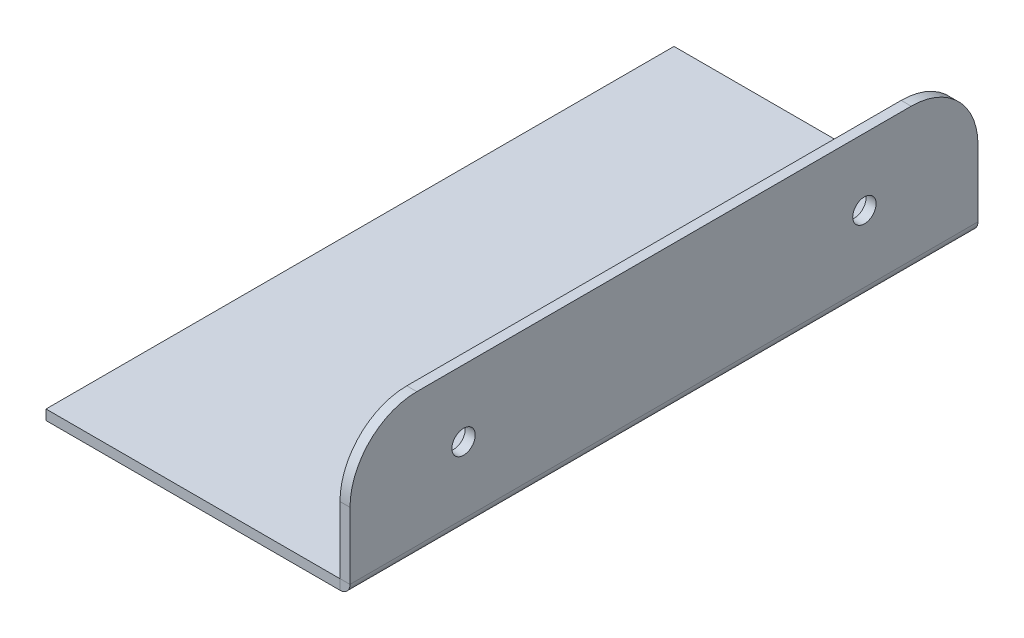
ISO-10303-21;
HEADER;
FILE_DESCRIPTION(('STEP AP214'),'2;1');
FILE_NAME('part.step','',(''),(''),'','','');
FILE_SCHEMA(('AUTOMOTIVE_DESIGN { 1 0 10303 214 1 1 1 1 }'));
ENDSEC;
DATA;
#1=APPLICATION_CONTEXT('core data for automotive mechanical design processes');
#2=APPLICATION_PROTOCOL_DEFINITION('international standard','automotive_design',2000,#1);
#3=PRODUCT_CONTEXT('',#1,'mechanical');
#4=PRODUCT('Part','Part','',(#3));
#5=PRODUCT_RELATED_PRODUCT_CATEGORY('part','',(#4));
#6=PRODUCT_DEFINITION_FORMATION('','',#4);
#7=PRODUCT_DEFINITION_CONTEXT('part definition',#1,'design');
#8=PRODUCT_DEFINITION('design','',#6,#7);
#9=PRODUCT_DEFINITION_SHAPE('','',#8);
#10=(LENGTH_UNIT() NAMED_UNIT(*) SI_UNIT(.MILLI.,.METRE.));
#11=(NAMED_UNIT(*) PLANE_ANGLE_UNIT() SI_UNIT($,.RADIAN.));
#12=(NAMED_UNIT(*) SI_UNIT($,.STERADIAN.) SOLID_ANGLE_UNIT());
#13=UNCERTAINTY_MEASURE_WITH_UNIT(LENGTH_MEASURE(1.E-05),#10,'distance_accuracy_value','');
#14=(GEOMETRIC_REPRESENTATION_CONTEXT(3) GLOBAL_UNCERTAINTY_ASSIGNED_CONTEXT((#13)) GLOBAL_UNIT_ASSIGNED_CONTEXT((#10,
#11,#12)) REPRESENTATION_CONTEXT('',''));
#15=CARTESIAN_POINT('',(0.,0.,0.));
#16=DIRECTION('',(0.,0.,1.));
#17=DIRECTION('',(1.,0.,0.));
#18=AXIS2_PLACEMENT_3D('',#15,#16,#17);
#19=CARTESIAN_POINT('',(44.0021342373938,-42.4978657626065,-94.));
#20=DIRECTION('',(0.,0.,1.));
#21=DIRECTION('',(0.,1.,0.));
#22=AXIS2_PLACEMENT_3D('',#19,#20,#21);
#23=PLANE('',#22);
#24=DIRECTION('',(0.,-1.,0.));
#25=VECTOR('',#24,1.);
#26=CARTESIAN_POINT('',(45.5021342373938,-42.4978657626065,-94.));
#27=LINE('',#26,#25);
#28=CARTESIAN_POINT('',(45.5021342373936,11.5021342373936,-94.));
#29=VERTEX_POINT('',#28);
#30=CARTESIAN_POINT('',(45.5021342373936,1.51,-94.));
#31=VERTEX_POINT('',#30);
#32=EDGE_CURVE('E61',#29,#31,#27,.T.);
#33=ORIENTED_EDGE('',*,*,#32,.T.);
#34=DIRECTION('',(-1.,0.,0.));
#35=VECTOR('',#34,1.);
#36=CARTESIAN_POINT('',(44.0021342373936,1.51,-94.));
#37=LINE('',#36,#35);
#38=CARTESIAN_POINT('',(44.0021342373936,1.51,-94.));
#39=VERTEX_POINT('',#38);
#40=EDGE_CURVE('E226',#31,#39,#37,.T.);
#41=ORIENTED_EDGE('',*,*,#40,.T.);
#42=DIRECTION('',(0.,-1.,0.));
#43=VECTOR('',#42,1.);
#44=CARTESIAN_POINT('',(44.0021342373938,-42.4978657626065,-94.));
#45=LINE('',#44,#43);
#46=CARTESIAN_POINT('',(44.0021342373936,11.5021342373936,-94.));
#47=VERTEX_POINT('',#46);
#48=EDGE_CURVE('E207',#47,#39,#45,.T.);
#49=ORIENTED_EDGE('',*,*,#48,.F.);
#50=DIRECTION('',(1.,0.,0.));
#51=VECTOR('',#50,1.);
#52=CARTESIAN_POINT('',(44.0021342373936,11.5021342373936,-94.));
#53=LINE('',#52,#51);
#54=EDGE_CURVE('E214',#47,#29,#53,.T.);
#55=ORIENTED_EDGE('',*,*,#54,.T.);
#56=EDGE_LOOP('',(#33,#41,#49,#55));
#57=FACE_BOUND('',#56,.T.);
#58=ADVANCED_FACE('F37',(#57),#23,.F.);
#59=CARTESIAN_POINT('',(44.0021342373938,-42.4978657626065,0.));
#60=DIRECTION('',(0.,0.,-1.));
#61=DIRECTION('',(0.,-1.,0.));
#62=AXIS2_PLACEMENT_3D('',#59,#60,#61);
#63=PLANE('',#62);
#64=DIRECTION('',(0.,1.,0.));
#65=VECTOR('',#64,1.);
#66=CARTESIAN_POINT('',(44.0021342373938,-42.4978657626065,0.));
#67=LINE('',#66,#65);
#68=CARTESIAN_POINT('',(44.0021342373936,1.51,0.));
#69=VERTEX_POINT('',#68);
#70=CARTESIAN_POINT('',(44.0021342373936,11.5021342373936,0.));
#71=VERTEX_POINT('',#70);
#72=EDGE_CURVE('E41',#69,#71,#67,.T.);
#73=ORIENTED_EDGE('',*,*,#72,.F.);
#74=DIRECTION('',(1.,0.,0.));
#75=VECTOR('',#74,1.);
#76=CARTESIAN_POINT('',(44.0021342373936,1.51,0.));
#77=LINE('',#76,#75);
#78=CARTESIAN_POINT('',(45.5021342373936,1.51,0.));
#79=VERTEX_POINT('',#78);
#80=EDGE_CURVE('E12',#69,#79,#77,.T.);
#81=ORIENTED_EDGE('',*,*,#80,.T.);
#82=DIRECTION('',(0.,1.,0.));
#83=VECTOR('',#82,1.);
#84=CARTESIAN_POINT('',(45.5021342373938,-42.4978657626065,0.));
#85=LINE('',#84,#83);
#86=CARTESIAN_POINT('',(45.5021342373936,11.5021342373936,0.));
#87=VERTEX_POINT('',#86);
#88=EDGE_CURVE('E54',#79,#87,#85,.T.);
#89=ORIENTED_EDGE('',*,*,#88,.T.);
#90=DIRECTION('',(1.,0.,0.));
#91=VECTOR('',#90,1.);
#92=CARTESIAN_POINT('',(44.0021342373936,11.5021342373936,0.));
#93=LINE('',#92,#91);
#94=EDGE_CURVE('E222',#71,#87,#93,.T.);
#95=ORIENTED_EDGE('',*,*,#94,.F.);
#96=EDGE_LOOP('',(#73,#81,#89,#95));
#97=FACE_BOUND('',#96,.T.);
#98=ADVANCED_FACE('F39',(#97),#63,.F.);
#99=CARTESIAN_POINT('',(45.5021342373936,11.5021342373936,-84.));
#100=DIRECTION('',(-1.,0.,0.));
#101=DIRECTION('',(0.,0.,1.));
#102=AXIS2_PLACEMENT_3D('',#99,#100,#101);
#103=PLANE('',#102);
#104=CARTESIAN_POINT('',(45.5021342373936,11.5021342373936,-17.));
#105=DIRECTION('',(-1.,0.,0.));
#106=DIRECTION('',(0.,0.,1.));
#107=AXIS2_PLACEMENT_3D('',#104,#105,#106);
#108=CIRCLE('',#107,1.75);
#109=CARTESIAN_POINT('',(45.5021342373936,11.5021342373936,-15.25));
#110=VERTEX_POINT('',#109);
#111=EDGE_CURVE('E166',#110,#110,#108,.T.);
#112=ORIENTED_EDGE('',*,*,#111,.T.);
#113=EDGE_LOOP('',(#112));
#114=FACE_BOUND('',#113,.T.);
#115=CARTESIAN_POINT('',(45.5021342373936,11.5021342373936,-77.));
#116=DIRECTION('',(-1.,0.,0.));
#117=DIRECTION('',(0.,0.,1.));
#118=AXIS2_PLACEMENT_3D('',#115,#116,#117);
#119=CIRCLE('',#118,1.75);
#120=CARTESIAN_POINT('',(45.5021342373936,11.5021342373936,-75.25));
#121=VERTEX_POINT('',#120);
#122=EDGE_CURVE('E193',#121,#121,#119,.T.);
#123=ORIENTED_EDGE('',*,*,#122,.T.);
#124=EDGE_LOOP('',(#123));
#125=FACE_BOUND('',#124,.T.);
#126=ORIENTED_EDGE('',*,*,#88,.F.);
#127=DIRECTION('',(0.,0.,-1.));
#128=VECTOR('',#127,1.);
#129=CARTESIAN_POINT('',(45.5021342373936,1.51,-84.));
#130=LINE('',#129,#128);
#131=EDGE_CURVE('E46',#79,#31,#130,.T.);
#132=ORIENTED_EDGE('',*,*,#131,.T.);
#133=ORIENTED_EDGE('',*,*,#32,.F.);
#134=CARTESIAN_POINT('',(45.5021342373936,11.5021342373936,-84.));
#135=DIRECTION('',(-1.,0.,0.));
#136=DIRECTION('',(0.,0.,1.));
#137=AXIS2_PLACEMENT_3D('',#134,#135,#136);
#138=CIRCLE('',#137,9.99999999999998);
#139=CARTESIAN_POINT('',(45.5021342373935,21.5021342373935,-84.));
#140=VERTEX_POINT('',#139);
#141=EDGE_CURVE('E212',#140,#29,#138,.T.);
#142=ORIENTED_EDGE('',*,*,#141,.F.);
#143=DIRECTION('',(0.,0.,-1.));
#144=VECTOR('',#143,1.);
#145=CARTESIAN_POINT('',(45.5021342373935,21.5021342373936,-10.));
#146=LINE('',#145,#144);
#147=CARTESIAN_POINT('',(45.5021342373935,21.5021342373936,-10.));
#148=VERTEX_POINT('',#147);
#149=EDGE_CURVE('E210',#148,#140,#146,.T.);
#150=ORIENTED_EDGE('',*,*,#149,.F.);
#151=CARTESIAN_POINT('',(45.5021342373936,11.5021342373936,-10.));
#152=DIRECTION('',(-1.,0.,0.));
#153=DIRECTION('',(0.,0.,1.));
#154=AXIS2_PLACEMENT_3D('',#151,#152,#153);
#155=CIRCLE('',#154,10.);
#156=EDGE_CURVE('E208',#87,#148,#155,.T.);
#157=ORIENTED_EDGE('',*,*,#156,.F.);
#158=EDGE_LOOP('',(#126,#132,#133,#142,#150,#157));
#159=FACE_BOUND('',#158,.T.);
#160=ADVANCED_FACE('F275',(#114,#125,#159),#103,.F.);
#161=CARTESIAN_POINT('',(44.0021342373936,11.5021342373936,-84.));
#162=DIRECTION('',(-1.,0.,0.));
#163=DIRECTION('',(0.,0.,1.));
#164=AXIS2_PLACEMENT_3D('',#161,#162,#163);
#165=PLANE('',#164);
#166=DIRECTION('',(0.,0.,-1.));
#167=VECTOR('',#166,1.);
#168=CARTESIAN_POINT('',(44.0021342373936,1.51,-84.));
#169=LINE('',#168,#167);
#170=EDGE_CURVE('E152',#69,#39,#169,.T.);
#171=ORIENTED_EDGE('',*,*,#170,.F.);
#172=ORIENTED_EDGE('',*,*,#72,.T.);
#173=CARTESIAN_POINT('',(44.0021342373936,11.5021342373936,-10.));
#174=DIRECTION('',(-1.,0.,0.));
#175=DIRECTION('',(0.,0.,1.));
#176=AXIS2_PLACEMENT_3D('',#173,#174,#175);
#177=CIRCLE('',#176,10.);
#178=CARTESIAN_POINT('',(44.0021342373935,21.5021342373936,-10.));
#179=VERTEX_POINT('',#178);
#180=EDGE_CURVE('E201',#71,#179,#177,.T.);
#181=ORIENTED_EDGE('',*,*,#180,.T.);
#182=DIRECTION('',(0.,0.,-1.));
#183=VECTOR('',#182,1.);
#184=CARTESIAN_POINT('',(44.0021342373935,21.5021342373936,-10.));
#185=LINE('',#184,#183);
#186=CARTESIAN_POINT('',(44.0021342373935,21.5021342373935,-84.));
#187=VERTEX_POINT('',#186);
#188=EDGE_CURVE('E203',#179,#187,#185,.T.);
#189=ORIENTED_EDGE('',*,*,#188,.T.);
#190=CARTESIAN_POINT('',(44.0021342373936,11.5021342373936,-84.));
#191=DIRECTION('',(-1.,0.,0.));
#192=DIRECTION('',(0.,0.,1.));
#193=AXIS2_PLACEMENT_3D('',#190,#191,#192);
#194=CIRCLE('',#193,9.99999999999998);
#195=EDGE_CURVE('E205',#187,#47,#194,.T.);
#196=ORIENTED_EDGE('',*,*,#195,.T.);
#197=ORIENTED_EDGE('',*,*,#48,.T.);
#198=EDGE_LOOP('',(#171,#172,#181,#189,#196,#197));
#199=FACE_BOUND('',#198,.T.);
#200=CARTESIAN_POINT('',(44.0021342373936,11.5021342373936,-77.));
#201=DIRECTION('',(-1.,0.,0.));
#202=DIRECTION('',(0.,0.,1.));
#203=AXIS2_PLACEMENT_3D('',#200,#201,#202);
#204=CIRCLE('',#203,1.75);
#205=CARTESIAN_POINT('',(44.0021342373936,11.5021342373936,-75.25));
#206=VERTEX_POINT('',#205);
#207=EDGE_CURVE('E196',#206,#206,#204,.T.);
#208=ORIENTED_EDGE('',*,*,#207,.F.);
#209=EDGE_LOOP('',(#208));
#210=FACE_BOUND('',#209,.T.);
#211=CARTESIAN_POINT('',(44.0021342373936,11.5021342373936,-17.));
#212=DIRECTION('',(-1.,0.,0.));
#213=DIRECTION('',(0.,0.,1.));
#214=AXIS2_PLACEMENT_3D('',#211,#212,#213);
#215=CIRCLE('',#214,1.75);
#216=CARTESIAN_POINT('',(44.0021342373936,11.5021342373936,-15.25));
#217=VERTEX_POINT('',#216);
#218=EDGE_CURVE('E190',#217,#217,#215,.T.);
#219=ORIENTED_EDGE('',*,*,#218,.F.);
#220=EDGE_LOOP('',(#219));
#221=FACE_BOUND('',#220,.T.);
#222=ADVANCED_FACE('F233',(#199,#210,#221),#165,.T.);
#223=CARTESIAN_POINT('',(44.0021342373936,11.5021342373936,-10.));
#224=DIRECTION('',(1.,0.,0.));
#225=DIRECTION('',(0.,0.,-1.));
#226=AXIS2_PLACEMENT_3D('',#223,#224,#225);
#227=CYLINDRICAL_SURFACE('',#226,10.);
#228=ORIENTED_EDGE('',*,*,#156,.T.);
#229=DIRECTION('',(1.,0.,0.));
#230=VECTOR('',#229,1.);
#231=CARTESIAN_POINT('',(44.0021342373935,21.5021342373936,-10.));
#232=LINE('',#231,#230);
#233=EDGE_CURVE('E219',#179,#148,#232,.T.);
#234=ORIENTED_EDGE('',*,*,#233,.F.);
#235=ORIENTED_EDGE('',*,*,#180,.F.);
#236=ORIENTED_EDGE('',*,*,#94,.T.);
#237=EDGE_LOOP('',(#228,#234,#235,#236));
#238=FACE_BOUND('',#237,.T.);
#239=ADVANCED_FACE('F284',(#238),#227,.T.);
#240=CARTESIAN_POINT('',(44.0021342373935,21.5021342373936,-10.));
#241=DIRECTION('',(0.,-1.,0.));
#242=DIRECTION('',(0.,0.,1.));
#243=AXIS2_PLACEMENT_3D('',#240,#241,#242);
#244=PLANE('',#243);
#245=ORIENTED_EDGE('',*,*,#149,.T.);
#246=DIRECTION('',(1.,0.,0.));
#247=VECTOR('',#246,1.);
#248=CARTESIAN_POINT('',(44.0021342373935,21.5021342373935,-84.));
#249=LINE('',#248,#247);
#250=EDGE_CURVE('E216',#187,#140,#249,.T.);
#251=ORIENTED_EDGE('',*,*,#250,.F.);
#252=ORIENTED_EDGE('',*,*,#188,.F.);
#253=ORIENTED_EDGE('',*,*,#233,.T.);
#254=EDGE_LOOP('',(#245,#251,#252,#253));
#255=FACE_BOUND('',#254,.T.);
#256=ADVANCED_FACE('F296',(#255),#244,.F.);
#257=CARTESIAN_POINT('',(44.0021342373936,11.5021342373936,-84.));
#258=DIRECTION('',(1.,0.,0.));
#259=DIRECTION('',(0.,0.,-1.));
#260=AXIS2_PLACEMENT_3D('',#257,#258,#259);
#261=CYLINDRICAL_SURFACE('',#260,9.99999999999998);
#262=ORIENTED_EDGE('',*,*,#141,.T.);
#263=ORIENTED_EDGE('',*,*,#54,.F.);
#264=ORIENTED_EDGE('',*,*,#195,.F.);
#265=ORIENTED_EDGE('',*,*,#250,.T.);
#266=EDGE_LOOP('',(#262,#263,#264,#265));
#267=FACE_BOUND('',#266,.T.);
#268=ADVANCED_FACE('F290',(#267),#261,.T.);
#269=CARTESIAN_POINT('',(44.0021342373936,11.5021342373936,-77.));
#270=DIRECTION('',(1.,0.,0.));
#271=DIRECTION('',(0.,0.,-1.));
#272=AXIS2_PLACEMENT_3D('',#269,#270,#271);
#273=CYLINDRICAL_SURFACE('',#272,1.75);
#274=ORIENTED_EDGE('',*,*,#207,.T.);
#275=EDGE_LOOP('',(#274));
#276=FACE_BOUND('',#275,.T.);
#277=ORIENTED_EDGE('',*,*,#122,.F.);
#278=EDGE_LOOP('',(#277));
#279=FACE_BOUND('',#278,.T.);
#280=ADVANCED_FACE('F266',(#276,#279),#273,.F.);
#281=CARTESIAN_POINT('',(44.0021342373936,11.5021342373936,-17.));
#282=DIRECTION('',(1.,0.,0.));
#283=DIRECTION('',(0.,0.,-1.));
#284=AXIS2_PLACEMENT_3D('',#281,#282,#283);
#285=CYLINDRICAL_SURFACE('',#284,1.75);
#286=ORIENTED_EDGE('',*,*,#218,.T.);
#287=EDGE_LOOP('',(#286));
#288=FACE_BOUND('',#287,.T.);
#289=ORIENTED_EDGE('',*,*,#111,.F.);
#290=EDGE_LOOP('',(#289));
#291=FACE_BOUND('',#290,.T.);
#292=ADVANCED_FACE('F257',(#288,#291),#285,.F.);
#293=CARTESIAN_POINT('',(0.,1.5,0.));
#294=DIRECTION('',(1.,0.,0.));
#295=DIRECTION('',(0.,0.,-1.));
#296=AXIS2_PLACEMENT_3D('',#293,#294,#295);
#297=PLANE('',#296);
#298=DIRECTION('',(0.,0.,1.));
#299=VECTOR('',#298,1.);
#300=CARTESIAN_POINT('',(0.,0.,0.));
#301=LINE('',#300,#299);
#302=CARTESIAN_POINT('',(0.,0.,-94.));
#303=VERTEX_POINT('',#302);
#304=CARTESIAN_POINT('',(0.,0.,0.));
#305=VERTEX_POINT('',#304);
#306=EDGE_CURVE('E147',#303,#305,#301,.T.);
#307=ORIENTED_EDGE('',*,*,#306,.T.);
#308=DIRECTION('',(0.,-1.,0.));
#309=VECTOR('',#308,1.);
#310=CARTESIAN_POINT('',(0.,1.5,0.));
#311=LINE('',#310,#309);
#312=CARTESIAN_POINT('',(0.,1.5,0.));
#313=VERTEX_POINT('',#312);
#314=EDGE_CURVE('E167',#313,#305,#311,.T.);
#315=ORIENTED_EDGE('',*,*,#314,.F.);
#316=DIRECTION('',(0.,0.,1.));
#317=VECTOR('',#316,1.);
#318=CARTESIAN_POINT('',(0.,1.5,0.));
#319=LINE('',#318,#317);
#320=CARTESIAN_POINT('',(0.,1.5,-94.));
#321=VERTEX_POINT('',#320);
#322=EDGE_CURVE('E127',#321,#313,#319,.T.);
#323=ORIENTED_EDGE('',*,*,#322,.F.);
#324=DIRECTION('',(0.,-1.,0.));
#325=VECTOR('',#324,1.);
#326=CARTESIAN_POINT('',(0.,1.5,-94.));
#327=LINE('',#326,#325);
#328=EDGE_CURVE('E123',#321,#303,#327,.T.);
#329=ORIENTED_EDGE('',*,*,#328,.T.);
#330=EDGE_LOOP('',(#307,#315,#323,#329));
#331=FACE_BOUND('',#330,.T.);
#332=ADVANCED_FACE('F254',(#331),#297,.F.);
#333=CARTESIAN_POINT('',(34.,1.5,-17.));
#334=DIRECTION('',(0.,-1.,0.));
#335=DIRECTION('',(0.,0.,-1.));
#336=AXIS2_PLACEMENT_3D('',#333,#334,#335);
#337=CYLINDRICAL_SURFACE('',#336,1.75);
#338=CARTESIAN_POINT('',(34.,1.5,-17.));
#339=DIRECTION('',(0.,1.,0.));
#340=DIRECTION('',(0.,0.,1.));
#341=AXIS2_PLACEMENT_3D('',#338,#339,#340);
#342=CIRCLE('',#341,1.75);
#343=CARTESIAN_POINT('',(34.,1.5,-15.25));
#344=VERTEX_POINT('',#343);
#345=EDGE_CURVE('E183',#344,#344,#342,.T.);
#346=ORIENTED_EDGE('',*,*,#345,.T.);
#347=EDGE_LOOP('',(#346));
#348=FACE_BOUND('',#347,.T.);
#349=CARTESIAN_POINT('',(34.,0.,-17.));
#350=DIRECTION('',(0.,1.,0.));
#351=DIRECTION('',(0.,0.,1.));
#352=AXIS2_PLACEMENT_3D('',#349,#350,#351);
#353=CIRCLE('',#352,1.75);
#354=CARTESIAN_POINT('',(34.,0.,-15.25));
#355=VERTEX_POINT('',#354);
#356=EDGE_CURVE('E170',#355,#355,#353,.T.);
#357=ORIENTED_EDGE('',*,*,#356,.F.);
#358=EDGE_LOOP('',(#357));
#359=FACE_BOUND('',#358,.T.);
#360=ADVANCED_FACE('F256',(#348,#359),#337,.F.);
#361=CARTESIAN_POINT('',(34.,1.5,-77.));
#362=DIRECTION('',(0.,-1.,0.));
#363=DIRECTION('',(0.,0.,-1.));
#364=AXIS2_PLACEMENT_3D('',#361,#362,#363);
#365=CYLINDRICAL_SURFACE('',#364,1.75);
#366=CARTESIAN_POINT('',(34.,1.5,-77.));
#367=DIRECTION('',(0.,1.,0.));
#368=DIRECTION('',(0.,0.,1.));
#369=AXIS2_PLACEMENT_3D('',#366,#367,#368);
#370=CIRCLE('',#369,1.75);
#371=CARTESIAN_POINT('',(34.,1.5,-75.25));
#372=VERTEX_POINT('',#371);
#373=EDGE_CURVE('E180',#372,#372,#370,.T.);
#374=ORIENTED_EDGE('',*,*,#373,.T.);
#375=EDGE_LOOP('',(#374));
#376=FACE_BOUND('',#375,.T.);
#377=CARTESIAN_POINT('',(34.,0.,-77.));
#378=DIRECTION('',(0.,1.,0.));
#379=DIRECTION('',(0.,0.,1.));
#380=AXIS2_PLACEMENT_3D('',#377,#378,#379);
#381=CIRCLE('',#380,1.75);
#382=CARTESIAN_POINT('',(34.,0.,-75.25));
#383=VERTEX_POINT('',#382);
#384=EDGE_CURVE('E173',#383,#383,#381,.T.);
#385=ORIENTED_EDGE('',*,*,#384,.F.);
#386=EDGE_LOOP('',(#385));
#387=FACE_BOUND('',#386,.T.);
#388=ADVANCED_FACE('F263',(#376,#387),#365,.F.);
#389=CARTESIAN_POINT('',(54.,1.5,-84.));
#390=DIRECTION('',(0.,1.,0.));
#391=DIRECTION('',(0.,0.,1.));
#392=AXIS2_PLACEMENT_3D('',#389,#390,#391);
#393=PLANE('',#392);
#394=ORIENTED_EDGE('',*,*,#373,.F.);
#395=EDGE_LOOP('',(#394));
#396=FACE_BOUND('',#395,.T.);
#397=ORIENTED_EDGE('',*,*,#345,.F.);
#398=EDGE_LOOP('',(#397));
#399=FACE_BOUND('',#398,.T.);
#400=DIRECTION('',(1.,0.,0.));
#401=VECTOR('',#400,1.);
#402=CARTESIAN_POINT('',(0.,1.5,0.));
#403=LINE('',#402,#401);
#404=CARTESIAN_POINT('',(43.9921342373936,1.5,0.));
#405=VERTEX_POINT('',#404);
#406=EDGE_CURVE('E132',#313,#405,#403,.T.);
#407=ORIENTED_EDGE('',*,*,#406,.T.);
#408=DIRECTION('',(0.,0.,-1.));
#409=VECTOR('',#408,1.);
#410=CARTESIAN_POINT('',(43.9921342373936,1.5,-84.));
#411=LINE('',#410,#409);
#412=CARTESIAN_POINT('',(43.9921342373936,1.5,-94.));
#413=VERTEX_POINT('',#412);
#414=EDGE_CURVE('E128',#405,#413,#411,.T.);
#415=ORIENTED_EDGE('',*,*,#414,.T.);
#416=DIRECTION('',(-1.,0.,0.));
#417=VECTOR('',#416,1.);
#418=CARTESIAN_POINT('',(0.,1.5,-94.));
#419=LINE('',#418,#417);
#420=EDGE_CURVE('E116',#413,#321,#419,.T.);
#421=ORIENTED_EDGE('',*,*,#420,.T.);
#422=ORIENTED_EDGE('',*,*,#322,.T.);
#423=EDGE_LOOP('',(#407,#415,#421,#422));
#424=FACE_BOUND('',#423,.T.);
#425=ADVANCED_FACE('F131',(#396,#399,#424),#393,.T.);
#426=CARTESIAN_POINT('',(0.,1.5,-94.));
#427=DIRECTION('',(0.,0.,1.));
#428=DIRECTION('',(1.,0.,0.));
#429=AXIS2_PLACEMENT_3D('',#426,#427,#428);
#430=PLANE('',#429);
#431=DIRECTION('',(0.,1.,0.));
#432=VECTOR('',#431,1.);
#433=CARTESIAN_POINT('',(43.9921342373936,1.5,-94.));
#434=LINE('',#433,#432);
#435=CARTESIAN_POINT('',(43.9921342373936,0.,-94.));
#436=VERTEX_POINT('',#435);
#437=EDGE_CURVE('E120',#436,#413,#434,.T.);
#438=ORIENTED_EDGE('',*,*,#437,.F.);
#439=DIRECTION('',(-1.,0.,0.));
#440=VECTOR('',#439,1.);
#441=CARTESIAN_POINT('',(0.,0.,-94.));
#442=LINE('',#441,#440);
#443=EDGE_CURVE('E176',#436,#303,#442,.T.);
#444=ORIENTED_EDGE('',*,*,#443,.T.);
#445=ORIENTED_EDGE('',*,*,#328,.F.);
#446=ORIENTED_EDGE('',*,*,#420,.F.);
#447=EDGE_LOOP('',(#438,#444,#445,#446));
#448=FACE_BOUND('',#447,.T.);
#449=ADVANCED_FACE('F118',(#448),#430,.F.);
#450=CARTESIAN_POINT('',(54.,0.,-84.));
#451=DIRECTION('',(0.,1.,0.));
#452=DIRECTION('',(0.,0.,1.));
#453=AXIS2_PLACEMENT_3D('',#450,#451,#452);
#454=PLANE('',#453);
#455=DIRECTION('',(0.,0.,-1.));
#456=VECTOR('',#455,1.);
#457=CARTESIAN_POINT('',(43.9921342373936,0.,-84.));
#458=LINE('',#457,#456);
#459=CARTESIAN_POINT('',(43.9921342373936,0.,0.));
#460=VERTEX_POINT('',#459);
#461=EDGE_CURVE('E148',#460,#436,#458,.T.);
#462=ORIENTED_EDGE('',*,*,#461,.F.);
#463=DIRECTION('',(1.,0.,0.));
#464=VECTOR('',#463,1.);
#465=CARTESIAN_POINT('',(0.,0.,0.));
#466=LINE('',#465,#464);
#467=EDGE_CURVE('E164',#305,#460,#466,.T.);
#468=ORIENTED_EDGE('',*,*,#467,.F.);
#469=ORIENTED_EDGE('',*,*,#306,.F.);
#470=ORIENTED_EDGE('',*,*,#443,.F.);
#471=EDGE_LOOP('',(#462,#468,#469,#470));
#472=FACE_BOUND('',#471,.T.);
#473=ORIENTED_EDGE('',*,*,#384,.T.);
#474=EDGE_LOOP('',(#473));
#475=FACE_BOUND('',#474,.T.);
#476=ORIENTED_EDGE('',*,*,#356,.T.);
#477=EDGE_LOOP('',(#476));
#478=FACE_BOUND('',#477,.T.);
#479=ADVANCED_FACE('F244',(#472,#475,#478),#454,.F.);
#480=CARTESIAN_POINT('',(0.,1.5,0.));
#481=DIRECTION('',(0.,0.,-1.));
#482=DIRECTION('',(-1.,0.,0.));
#483=AXIS2_PLACEMENT_3D('',#480,#481,#482);
#484=PLANE('',#483);
#485=DIRECTION('',(0.,-1.,0.));
#486=VECTOR('',#485,1.);
#487=CARTESIAN_POINT('',(43.9921342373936,1.5,0.));
#488=LINE('',#487,#486);
#489=EDGE_CURVE('E153',#405,#460,#488,.T.);
#490=ORIENTED_EDGE('',*,*,#489,.F.);
#491=ORIENTED_EDGE('',*,*,#406,.F.);
#492=ORIENTED_EDGE('',*,*,#314,.T.);
#493=ORIENTED_EDGE('',*,*,#467,.T.);
#494=EDGE_LOOP('',(#490,#491,#492,#493));
#495=FACE_BOUND('',#494,.T.);
#496=ADVANCED_FACE('F251',(#495),#484,.F.);
#497=CARTESIAN_POINT('',(43.9921342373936,1.51,0.));
#498=DIRECTION('',(0.,0.,-1.));
#499=DIRECTION('',(-1.,0.,0.));
#500=AXIS2_PLACEMENT_3D('',#497,#498,#499);
#501=PLANE('',#500);
#502=ORIENTED_EDGE('',*,*,#489,.T.);
#503=CARTESIAN_POINT('',(43.9921342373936,1.51,0.));
#504=DIRECTION('',(0.,0.,-1.));
#505=DIRECTION('',(-1.,0.,0.));
#506=AXIS2_PLACEMENT_3D('',#503,#504,#505);
#507=CIRCLE('',#506,1.51);
#508=EDGE_CURVE('E160',#460,#79,#507,.F.);
#509=ORIENTED_EDGE('',*,*,#508,.T.);
#510=ORIENTED_EDGE('',*,*,#80,.F.);
#511=CARTESIAN_POINT('',(43.9921342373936,1.51,0.));
#512=DIRECTION('',(0.,0.,1.));
#513=DIRECTION('',(1.,0.,0.));
#514=AXIS2_PLACEMENT_3D('',#511,#512,#513);
#515=CIRCLE('',#514,0.0100000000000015);
#516=EDGE_CURVE('E154',#405,#69,#515,.T.);
#517=ORIENTED_EDGE('',*,*,#516,.F.);
#518=EDGE_LOOP('',(#502,#509,#510,#517));
#519=FACE_BOUND('',#518,.T.);
#520=ADVANCED_FACE('F248',(#519),#501,.F.);
#521=CARTESIAN_POINT('',(43.9921342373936,1.51,-94.));
#522=DIRECTION('',(0.,0.,1.));
#523=DIRECTION('',(1.,0.,0.));
#524=AXIS2_PLACEMENT_3D('',#521,#522,#523);
#525=PLANE('',#524);
#526=CARTESIAN_POINT('',(43.9921342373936,1.51,-94.));
#527=DIRECTION('',(0.,0.,-1.));
#528=DIRECTION('',(-1.,0.,0.));
#529=AXIS2_PLACEMENT_3D('',#526,#527,#528);
#530=CIRCLE('',#529,1.51);
#531=EDGE_CURVE('E146',#31,#436,#530,.T.);
#532=ORIENTED_EDGE('',*,*,#531,.T.);
#533=ORIENTED_EDGE('',*,*,#437,.T.);
#534=CARTESIAN_POINT('',(43.9921342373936,1.51,-94.));
#535=DIRECTION('',(0.,0.,-1.));
#536=DIRECTION('',(-1.,0.,0.));
#537=AXIS2_PLACEMENT_3D('',#534,#535,#536);
#538=CIRCLE('',#537,0.0100000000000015);
#539=EDGE_CURVE('E144',#39,#413,#538,.T.);
#540=ORIENTED_EDGE('',*,*,#539,.F.);
#541=ORIENTED_EDGE('',*,*,#40,.F.);
#542=EDGE_LOOP('',(#532,#533,#540,#541));
#543=FACE_BOUND('',#542,.T.);
#544=ADVANCED_FACE('F142',(#543),#525,.F.);
#545=CARTESIAN_POINT('',(43.9921342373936,1.51,47.0119686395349));
#546=DIRECTION('',(0.,0.,-1.));
#547=DIRECTION('',(-1.,0.,0.));
#548=AXIS2_PLACEMENT_3D('',#545,#546,#547);
#549=CYLINDRICAL_SURFACE('',#548,0.01);
#550=ORIENTED_EDGE('',*,*,#170,.T.);
#551=ORIENTED_EDGE('',*,*,#539,.T.);
#552=ORIENTED_EDGE('',*,*,#414,.F.);
#553=ORIENTED_EDGE('',*,*,#516,.T.);
#554=EDGE_LOOP('',(#550,#551,#552,#553));
#555=FACE_BOUND('',#554,.T.);
#556=ADVANCED_FACE('F151',(#555),#549,.F.);
#557=CARTESIAN_POINT('',(43.9921342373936,1.51,47.0119686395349));
#558=DIRECTION('',(0.,0.,-1.));
#559=DIRECTION('',(-1.,0.,0.));
#560=AXIS2_PLACEMENT_3D('',#557,#558,#559);
#561=CYLINDRICAL_SURFACE('',#560,1.51);
#562=ORIENTED_EDGE('',*,*,#131,.F.);
#563=ORIENTED_EDGE('',*,*,#508,.F.);
#564=ORIENTED_EDGE('',*,*,#461,.T.);
#565=ORIENTED_EDGE('',*,*,#531,.F.);
#566=EDGE_LOOP('',(#562,#563,#564,#565));
#567=FACE_BOUND('',#566,.T.);
#568=ADVANCED_FACE('F240',(#567),#561,.T.);
#569=CLOSED_SHELL('',(#58,#98,#160,#222,#239,#256,#268,#280,#292,#332,#360,#388,#425,#449,#479,
#496,#520,#544,#556,#568));
#570=MANIFOLD_SOLID_BREP('B2',#569);
#571=ADVANCED_BREP_SHAPE_REPRESENTATION('',(#18,#570),#14);
#572=SHAPE_DEFINITION_REPRESENTATION(#9,#571);
ENDSEC;
END-ISO-10303-21;
